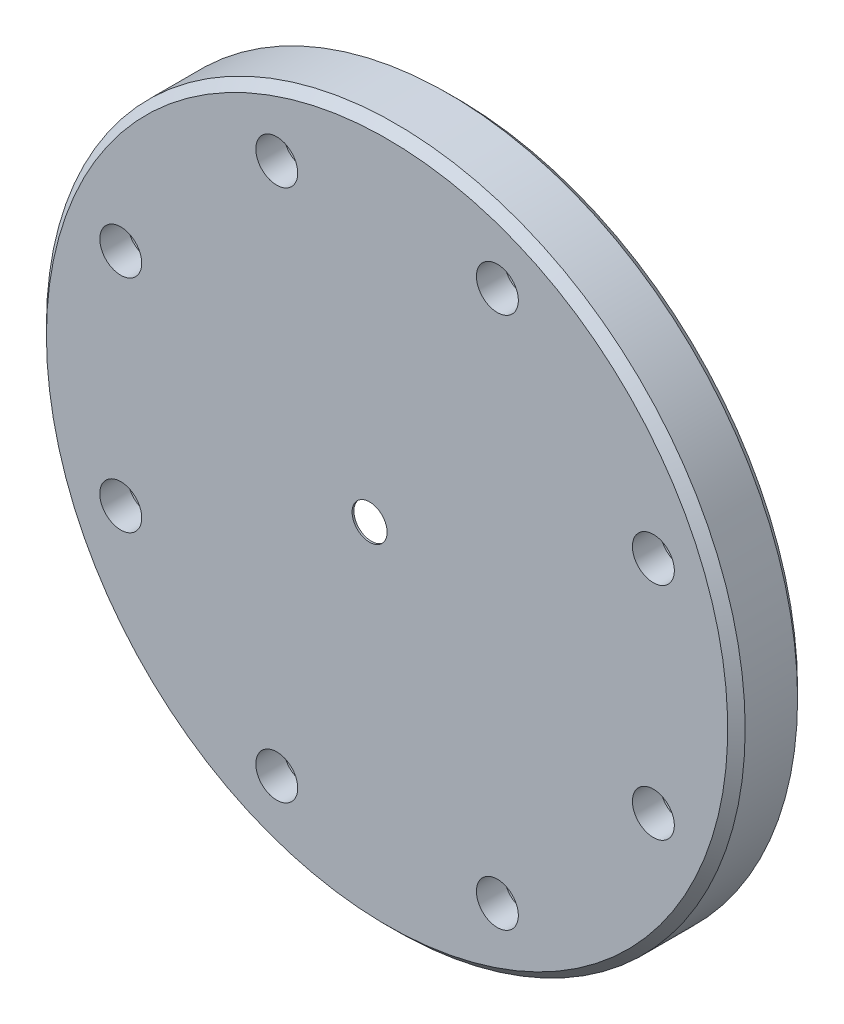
from build123d import *

# Parameters (mm, degrees)
ESQUISSE1_W                                        = 4
ESQUISSE1_H                                        = 20
CHAMBRAGE_POUR_VIS_T_TE_HEXAGONALE_M21_D           = 2.4
CHAMBRAGE_POUR_VIS_T_TE_HEXAGONALE_M21_CBORE_D     = 4.4
CHAMBRAGE_POUR_VIS_T_TE_HEXAGONALE_M21_CBORE_DEPTH = 2.4
R_P_TITION_CIRCULAIRE1_COUNT                       = 8
CHANFREIN1_SIZE                                    = 0.5


with BuildPart() as part:
    # Esquisse1 → R_volution1 (revolve)
    with BuildSketch(Plane(origin=(0, 0, 0), x_dir=(0, 0, -1), z_dir=(1, 0, 0)), mode=Mode.PRIVATE) as r_volution1_sk:
        with Locations((2, 10)):
            Rectangle(ESQUISSE1_W, ESQUISSE1_H)
    revolve(r_volution1_sk.sketch.rotate(Axis((0, 0, 8.202960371), (0, 0, -1)), 90), axis=Axis((0, 0, 8.202960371), (0, 0, -1)))

    # Chambrage pour vis _ t_te hexagonale M21 (through all)
    with Locations(Plane(origin=(0, 0, -4), x_dir=(-1, 0, 0), z_dir=(0, 0, -1))):
        with Locations((6.314276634, 15.244012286)):
            chambrage_pour_vis_t_te_hexagonale_m21 = CounterBoreHole(CHAMBRAGE_POUR_VIS_T_TE_HEXAGONALE_M21_D / 2, CHAMBRAGE_POUR_VIS_T_TE_HEXAGONALE_M21_CBORE_D / 2, CHAMBRAGE_POUR_VIS_T_TE_HEXAGONALE_M21_CBORE_DEPTH)

    # Esquisse6 → Enl_vement de mati_re-R_volution2 (revolve, cut)
    with BuildSketch(Plane(origin=(0, 0, 0), x_dir=(1, 0, 0), z_dir=(0, 1, 0))):
        Polygon((-1, 4), (-16.55499815, 4), (-2, 0.1), (-2, 0), (-1, 0), align=None)
    revolve(axis=Axis((-1, 0, -7.186340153), (0, 0, 1)), mode=Mode.SUBTRACT)

    # R_p_tition circulaire1: Chambrage pour vis _ t_te hexagonale M21 ×8 about axis
    r_p_tition_circulaire1_axis = Axis((0, 0, 0), (0, 0, 1))
    for i in range(1, R_P_TITION_CIRCULAIRE1_COUNT):
        add(chambrage_pour_vis_t_te_hexagonale_m21.rotate(r_p_tition_circulaire1_axis, i * 360 / R_P_TITION_CIRCULAIRE1_COUNT), mode=Mode.SUBTRACT)

    # Chanfrein1
    chanfrein1_edges = [part.edges().sort_by_distance(p)[0] for p in [
        (-20, 0, -4),
        (-20, 0, 0),
    ]]
    chamfer(chanfrein1_edges, length=CHANFREIN1_SIZE)


solid = part.part
